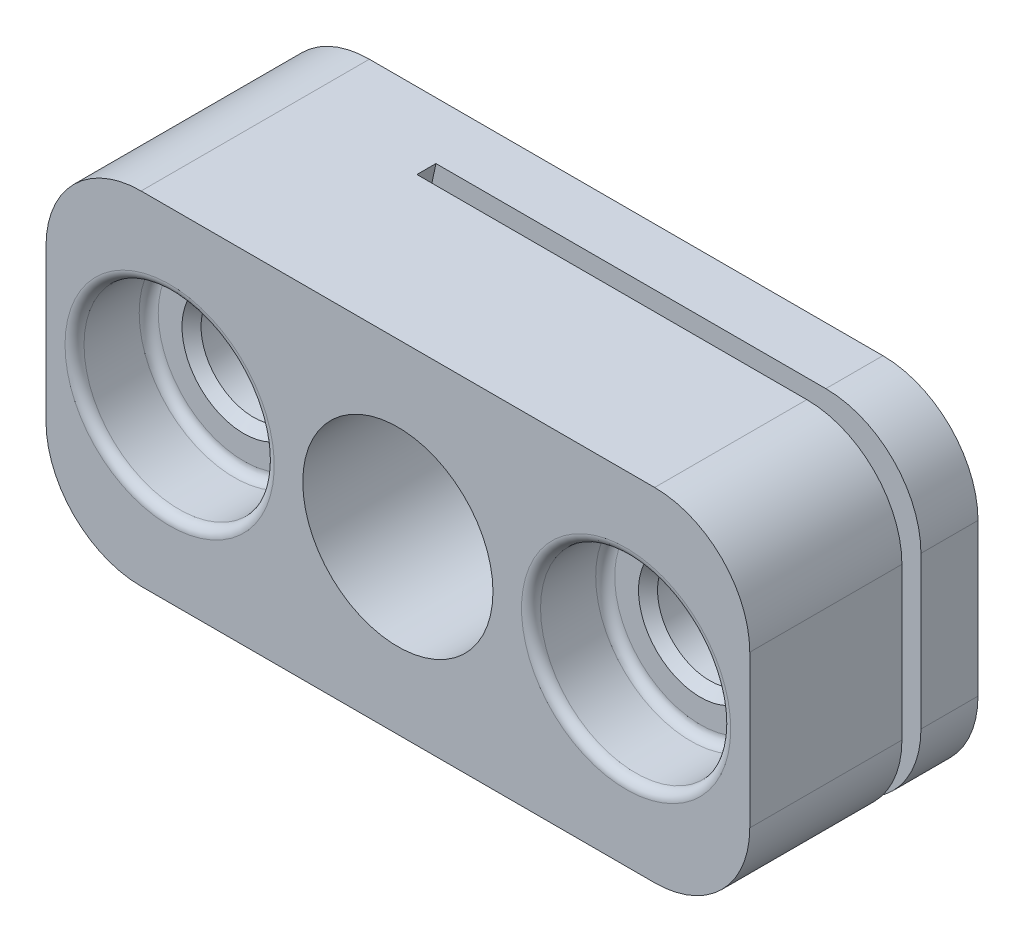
ISO-10303-21;
HEADER;
FILE_DESCRIPTION(('STEP AP214'),'2;1');
FILE_NAME('part.step','',(''),(''),'','','');
FILE_SCHEMA(('AUTOMOTIVE_DESIGN { 1 0 10303 214 1 1 1 1 }'));
ENDSEC;
DATA;
#1=APPLICATION_CONTEXT('core data for automotive mechanical design processes');
#2=APPLICATION_PROTOCOL_DEFINITION('international standard','automotive_design',2000,#1);
#3=PRODUCT_CONTEXT('',#1,'mechanical');
#4=PRODUCT('Part','Part','',(#3));
#5=PRODUCT_RELATED_PRODUCT_CATEGORY('part','',(#4));
#6=PRODUCT_DEFINITION_FORMATION('','',#4);
#7=PRODUCT_DEFINITION_CONTEXT('part definition',#1,'design');
#8=PRODUCT_DEFINITION('design','',#6,#7);
#9=PRODUCT_DEFINITION_SHAPE('','',#8);
#10=(LENGTH_UNIT() NAMED_UNIT(*) SI_UNIT(.MILLI.,.METRE.));
#11=(NAMED_UNIT(*) PLANE_ANGLE_UNIT() SI_UNIT($,.RADIAN.));
#12=(NAMED_UNIT(*) SI_UNIT($,.STERADIAN.) SOLID_ANGLE_UNIT());
#13=UNCERTAINTY_MEASURE_WITH_UNIT(LENGTH_MEASURE(1.E-05),#10,'distance_accuracy_value','');
#14=(GEOMETRIC_REPRESENTATION_CONTEXT(3) GLOBAL_UNCERTAINTY_ASSIGNED_CONTEXT((#13)) GLOBAL_UNIT_ASSIGNED_CONTEXT((#10,
#11,#12)) REPRESENTATION_CONTEXT('',''));
#15=CARTESIAN_POINT('',(0.,0.,0.));
#16=DIRECTION('',(0.,0.,1.));
#17=DIRECTION('',(1.,0.,0.));
#18=AXIS2_PLACEMENT_3D('',#15,#16,#17);
#19=CARTESIAN_POINT('',(27.25,0.,8.1));
#20=DIRECTION('',(0.,0.,1.));
#21=DIRECTION('',(1.,0.,0.));
#22=AXIS2_PLACEMENT_3D('',#19,#20,#21);
#23=PLANE('',#22);
#24=CARTESIAN_POINT('',(24.,0.,8.1000000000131));
#25=DIRECTION('',(0.,0.,1.));
#26=DIRECTION('',(1.,0.,0.));
#27=AXIS2_PLACEMENT_3D('',#24,#25,#26);
#28=CIRCLE('',#27,3.24999999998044);
#29=CARTESIAN_POINT('',(27.2499999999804,0.,8.1000000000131));
#30=VERTEX_POINT('',#29);
#31=EDGE_CURVE('E18',#30,#30,#28,.F.);
#32=ORIENTED_EDGE('',*,*,#31,.T.);
#33=EDGE_LOOP('',(#32));
#34=FACE_BOUND('',#33,.T.);
#35=CARTESIAN_POINT('',(24.,0.,8.09999999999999));
#36=DIRECTION('',(0.,0.,-1.));
#37=DIRECTION('',(1.,0.,0.));
#38=AXIS2_PLACEMENT_3D('',#35,#36,#37);
#39=CIRCLE('',#38,4.50000000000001);
#40=CARTESIAN_POINT('',(28.5,0.,8.09999999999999));
#41=VERTEX_POINT('',#40);
#42=EDGE_CURVE('E285',#41,#41,#39,.F.);
#43=ORIENTED_EDGE('',*,*,#42,.T.);
#44=EDGE_LOOP('',(#43));
#45=FACE_BOUND('',#44,.T.);
#46=ADVANCED_FACE('F14',(#34,#45),#23,.T.);
#47=CARTESIAN_POINT('',(24.,0.,8.6));
#48=DIRECTION('',(0.,0.,1.));
#49=DIRECTION('',(1.,0.,0.));
#50=AXIS2_PLACEMENT_3D('',#47,#48,#49);
#51=TOROIDAL_SURFACE('',#50,4.5,0.500000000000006);
#52=CARTESIAN_POINT('',(24.,0.,8.6));
#53=DIRECTION('',(0.,0.,-1.));
#54=DIRECTION('',(-1.,0.,0.));
#55=AXIS2_PLACEMENT_3D('',#52,#53,#54);
#56=CIRCLE('',#55,5.);
#57=CARTESIAN_POINT('',(19.,0.,8.6));
#58=VERTEX_POINT('',#57);
#59=EDGE_CURVE('E234',#58,#58,#56,.F.);
#60=ORIENTED_EDGE('',*,*,#59,.T.);
#61=EDGE_LOOP('',(#60));
#62=FACE_BOUND('',#61,.T.);
#63=ORIENTED_EDGE('',*,*,#42,.F.);
#64=EDGE_LOOP('',(#63));
#65=FACE_BOUND('',#64,.T.);
#66=ADVANCED_FACE('F267',(#62,#65),#51,.F.);
#67=CARTESIAN_POINT('',(0.,0.,8.6));
#68=DIRECTION('',(0.,0.,-1.));
#69=DIRECTION('',(-1.,0.,0.));
#70=AXIS2_PLACEMENT_3D('',#67,#68,#69);
#71=TOROIDAL_SURFACE('',#70,4.5,0.500000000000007);
#72=CARTESIAN_POINT('',(0.,0.,8.09999999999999));
#73=DIRECTION('',(0.,0.,-1.));
#74=DIRECTION('',(-1.,0.,0.));
#75=AXIS2_PLACEMENT_3D('',#72,#73,#74);
#76=CIRCLE('',#75,4.50000000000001);
#77=CARTESIAN_POINT('',(-4.50000000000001,0.,8.09999999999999));
#78=VERTEX_POINT('',#77);
#79=EDGE_CURVE('E245',#78,#78,#76,.F.);
#80=ORIENTED_EDGE('',*,*,#79,.F.);
#81=EDGE_LOOP('',(#80));
#82=FACE_BOUND('',#81,.T.);
#83=CARTESIAN_POINT('',(0.,0.,8.6));
#84=DIRECTION('',(0.,0.,1.));
#85=DIRECTION('',(1.,0.,0.));
#86=AXIS2_PLACEMENT_3D('',#83,#84,#85);
#87=CIRCLE('',#86,5.);
#88=CARTESIAN_POINT('',(5.,0.,8.6));
#89=VERTEX_POINT('',#88);
#90=EDGE_CURVE('E231',#89,#89,#87,.T.);
#91=ORIENTED_EDGE('',*,*,#90,.T.);
#92=EDGE_LOOP('',(#91));
#93=FACE_BOUND('',#92,.T.);
#94=ADVANCED_FACE('F263',(#82,#93),#71,.F.);
#95=CARTESIAN_POINT('',(-4.5,0.,8.1));
#96=DIRECTION('',(0.,0.,1.));
#97=DIRECTION('',(1.,0.,0.));
#98=AXIS2_PLACEMENT_3D('',#95,#96,#97);
#99=PLANE('',#98);
#100=ORIENTED_EDGE('',*,*,#79,.T.);
#101=EDGE_LOOP('',(#100));
#102=FACE_BOUND('',#101,.T.);
#103=CARTESIAN_POINT('',(0.,0.,8.1000000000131));
#104=DIRECTION('',(0.,0.,1.));
#105=DIRECTION('',(1.,0.,0.));
#106=AXIS2_PLACEMENT_3D('',#103,#104,#105);
#107=CIRCLE('',#106,3.25000000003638);
#108=CARTESIAN_POINT('',(3.25000000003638,0.,8.1000000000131));
#109=VERTEX_POINT('',#108);
#110=EDGE_CURVE('E228',#109,#109,#107,.F.);
#111=ORIENTED_EDGE('',*,*,#110,.T.);
#112=EDGE_LOOP('',(#111));
#113=FACE_BOUND('',#112,.T.);
#114=ADVANCED_FACE('F252',(#102,#113),#99,.T.);
#115=CARTESIAN_POINT('',(24.,0.,8.1000000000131));
#116=DIRECTION('',(0.,0.,1.));
#117=DIRECTION('',(1.,0.,0.));
#118=AXIS2_PLACEMENT_3D('',#115,#116,#117);
#119=CONICAL_SURFACE('',#118,3.24999999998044,0.785398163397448);
#120=CARTESIAN_POINT('',(24.,0.,7.6));
#121=DIRECTION('',(0.,0.,-1.));
#122=DIRECTION('',(-1.,0.,0.));
#123=AXIS2_PLACEMENT_3D('',#120,#121,#122);
#124=CIRCLE('',#123,2.75);
#125=CARTESIAN_POINT('',(21.25,0.,7.6));
#126=VERTEX_POINT('',#125);
#127=EDGE_CURVE('E224',#126,#126,#124,.T.);
#128=ORIENTED_EDGE('',*,*,#127,.T.);
#129=EDGE_LOOP('',(#128));
#130=FACE_BOUND('',#129,.T.);
#131=ORIENTED_EDGE('',*,*,#31,.F.);
#132=EDGE_LOOP('',(#131));
#133=FACE_BOUND('',#132,.T.);
#134=ADVANCED_FACE('F262',(#130,#133),#119,.F.);
#135=CARTESIAN_POINT('',(24.,0.,12.));
#136=DIRECTION('',(0.,0.,-1.));
#137=DIRECTION('',(-1.,0.,0.));
#138=AXIS2_PLACEMENT_3D('',#135,#136,#137);
#139=CYLINDRICAL_SURFACE('',#138,5.);
#140=ORIENTED_EDGE('',*,*,#59,.F.);
#141=EDGE_LOOP('',(#140));
#142=FACE_BOUND('',#141,.T.);
#143=CARTESIAN_POINT('',(24.,0.,11.5));
#144=DIRECTION('',(0.,0.,1.));
#145=DIRECTION('',(1.,0.,0.));
#146=AXIS2_PLACEMENT_3D('',#143,#144,#145);
#147=CIRCLE('',#146,5.);
#148=CARTESIAN_POINT('',(29.,0.,11.5));
#149=VERTEX_POINT('',#148);
#150=EDGE_CURVE('E125',#149,#149,#147,.F.);
#151=ORIENTED_EDGE('',*,*,#150,.F.);
#152=EDGE_LOOP('',(#151));
#153=FACE_BOUND('',#152,.T.);
#154=ADVANCED_FACE('F505',(#142,#153),#139,.F.);
#155=CARTESIAN_POINT('',(0.,0.,0.));
#156=DIRECTION('',(0.,0.,1.));
#157=DIRECTION('',(1.,0.,0.));
#158=AXIS2_PLACEMENT_3D('',#155,#156,#157);
#159=CYLINDRICAL_SURFACE('',#158,5.);
#160=CARTESIAN_POINT('',(0.,0.,11.5));
#161=DIRECTION('',(0.,0.,-1.));
#162=DIRECTION('',(-1.,0.,0.));
#163=AXIS2_PLACEMENT_3D('',#160,#161,#162);
#164=CIRCLE('',#163,5.);
#165=CARTESIAN_POINT('',(-5.,0.,11.5));
#166=VERTEX_POINT('',#165);
#167=EDGE_CURVE('E171',#166,#166,#164,.T.);
#168=ORIENTED_EDGE('',*,*,#167,.F.);
#169=EDGE_LOOP('',(#168));
#170=FACE_BOUND('',#169,.T.);
#171=ORIENTED_EDGE('',*,*,#90,.F.);
#172=EDGE_LOOP('',(#171));
#173=FACE_BOUND('',#172,.T.);
#174=ADVANCED_FACE('F349',(#170,#173),#159,.F.);
#175=CARTESIAN_POINT('',(0.,0.,8.1000000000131));
#176=DIRECTION('',(0.,0.,1.));
#177=DIRECTION('',(1.,0.,0.));
#178=AXIS2_PLACEMENT_3D('',#175,#176,#177);
#179=CONICAL_SURFACE('',#178,3.25000000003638,0.785398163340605);
#180=ORIENTED_EDGE('',*,*,#110,.F.);
#181=EDGE_LOOP('',(#180));
#182=FACE_BOUND('',#181,.T.);
#183=CARTESIAN_POINT('',(0.,0.,7.6));
#184=DIRECTION('',(0.,0.,1.));
#185=DIRECTION('',(1.,0.,0.));
#186=AXIS2_PLACEMENT_3D('',#183,#184,#185);
#187=CIRCLE('',#186,2.75);
#188=CARTESIAN_POINT('',(2.75,0.,7.6));
#189=VERTEX_POINT('',#188);
#190=EDGE_CURVE('E167',#189,#189,#187,.F.);
#191=ORIENTED_EDGE('',*,*,#190,.T.);
#192=EDGE_LOOP('',(#191));
#193=FACE_BOUND('',#192,.T.);
#194=ADVANCED_FACE('F345',(#182,#193),#179,.F.);
#195=CARTESIAN_POINT('',(24.,0.,12.));
#196=DIRECTION('',(0.,0.,-1.));
#197=DIRECTION('',(-1.,0.,0.));
#198=AXIS2_PLACEMENT_3D('',#195,#196,#197);
#199=CYLINDRICAL_SURFACE('',#198,2.75);
#200=CARTESIAN_POINT('',(24.,0.,4.));
#201=DIRECTION('',(0.,0.,-1.));
#202=DIRECTION('',(-1.,0.,0.));
#203=AXIS2_PLACEMENT_3D('',#200,#201,#202);
#204=CIRCLE('',#203,2.75);
#205=CARTESIAN_POINT('',(21.25,0.,4.));
#206=VERTEX_POINT('',#205);
#207=EDGE_CURVE('E135',#206,#206,#204,.T.);
#208=ORIENTED_EDGE('',*,*,#207,.T.);
#209=EDGE_LOOP('',(#208));
#210=FACE_BOUND('',#209,.T.);
#211=ORIENTED_EDGE('',*,*,#127,.F.);
#212=EDGE_LOOP('',(#211));
#213=FACE_BOUND('',#212,.T.);
#214=ADVANCED_FACE('F348',(#210,#213),#199,.F.);
#215=CARTESIAN_POINT('',(43.9743505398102,0.,4.));
#216=DIRECTION('',(0.,0.,1.));
#217=DIRECTION('',(1.,0.,0.));
#218=AXIS2_PLACEMENT_3D('',#215,#216,#217);
#219=CYLINDRICAL_SURFACE('',#218,40.);
#220=DIRECTION('',(0.,0.,1.));
#221=VECTOR('',#220,1.);
#222=CARTESIAN_POINT('',(5.,9.,4.));
#223=LINE('',#222,#221);
#224=CARTESIAN_POINT('',(5.,9.,4.));
#225=VERTEX_POINT('',#224);
#226=CARTESIAN_POINT('',(5.,9.,3.));
#227=VERTEX_POINT('',#226);
#228=EDGE_CURVE('E113',#225,#227,#223,.F.);
#229=ORIENTED_EDGE('',*,*,#228,.F.);
#230=CARTESIAN_POINT('',(43.9743505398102,0.,4.));
#231=DIRECTION('',(0.,0.,1.));
#232=DIRECTION('',(1.,0.,0.));
#233=AXIS2_PLACEMENT_3D('',#230,#231,#232);
#234=CIRCLE('',#233,40.);
#235=CARTESIAN_POINT('',(5.,-9.,4.));
#236=VERTEX_POINT('',#235);
#237=EDGE_CURVE('E177',#225,#236,#234,.T.);
#238=ORIENTED_EDGE('',*,*,#237,.T.);
#239=DIRECTION('',(0.,0.,1.));
#240=VECTOR('',#239,1.);
#241=CARTESIAN_POINT('',(5.,-9.,4.));
#242=LINE('',#241,#240);
#243=CARTESIAN_POINT('',(5.,-9.,3.));
#244=VERTEX_POINT('',#243);
#245=EDGE_CURVE('E126',#244,#236,#242,.T.);
#246=ORIENTED_EDGE('',*,*,#245,.F.);
#247=CARTESIAN_POINT('',(43.9743505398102,0.,3.));
#248=DIRECTION('',(0.,0.,1.));
#249=DIRECTION('',(1.,0.,0.));
#250=AXIS2_PLACEMENT_3D('',#247,#248,#249);
#251=CIRCLE('',#250,40.);
#252=EDGE_CURVE('E130',#227,#244,#251,.T.);
#253=ORIENTED_EDGE('',*,*,#252,.F.);
#254=EDGE_LOOP('',(#229,#238,#246,#253));
#255=FACE_BOUND('',#254,.T.);
#256=ADVANCED_FACE('F131',(#255),#219,.F.);
#257=CARTESIAN_POINT('',(24.,0.,11.5));
#258=DIRECTION('',(0.,0.,1.));
#259=DIRECTION('',(1.,0.,0.));
#260=AXIS2_PLACEMENT_3D('',#257,#258,#259);
#261=TOROIDAL_SURFACE('',#260,5.5,0.5);
#262=ORIENTED_EDGE('',*,*,#150,.T.);
#263=EDGE_LOOP('',(#262));
#264=FACE_BOUND('',#263,.T.);
#265=CARTESIAN_POINT('',(24.,0.,12.));
#266=DIRECTION('',(0.,0.,1.));
#267=DIRECTION('',(1.,0.,0.));
#268=AXIS2_PLACEMENT_3D('',#265,#266,#267);
#269=CIRCLE('',#268,5.5);
#270=CARTESIAN_POINT('',(29.5,0.,12.));
#271=VERTEX_POINT('',#270);
#272=EDGE_CURVE('E215',#271,#271,#269,.F.);
#273=ORIENTED_EDGE('',*,*,#272,.F.);
#274=EDGE_LOOP('',(#273));
#275=FACE_BOUND('',#274,.T.);
#276=ADVANCED_FACE('F189',(#264,#275),#261,.T.);
#277=CARTESIAN_POINT('',(0.,0.,11.5));
#278=DIRECTION('',(0.,0.,-1.));
#279=DIRECTION('',(-1.,0.,0.));
#280=AXIS2_PLACEMENT_3D('',#277,#278,#279);
#281=TOROIDAL_SURFACE('',#280,5.5,0.5);
#282=CARTESIAN_POINT('',(0.,0.,12.));
#283=DIRECTION('',(0.,0.,1.));
#284=DIRECTION('',(-1.,0.,0.));
#285=AXIS2_PLACEMENT_3D('',#282,#283,#284);
#286=CIRCLE('',#285,5.5);
#287=CARTESIAN_POINT('',(-5.5,0.,12.));
#288=VERTEX_POINT('',#287);
#289=EDGE_CURVE('E331',#288,#288,#286,.F.);
#290=ORIENTED_EDGE('',*,*,#289,.F.);
#291=EDGE_LOOP('',(#290));
#292=FACE_BOUND('',#291,.T.);
#293=ORIENTED_EDGE('',*,*,#167,.T.);
#294=EDGE_LOOP('',(#293));
#295=FACE_BOUND('',#294,.T.);
#296=ADVANCED_FACE('F183',(#292,#295),#281,.T.);
#297=CARTESIAN_POINT('',(30.5,-4.,12.));
#298=DIRECTION('',(-1.,0.,0.));
#299=DIRECTION('',(0.,0.,1.));
#300=AXIS2_PLACEMENT_3D('',#297,#298,#299);
#301=PLANE('',#300);
#302=DIRECTION('',(0.,1.,0.));
#303=VECTOR('',#302,1.);
#304=CARTESIAN_POINT('',(30.5,0.,4.));
#305=LINE('',#304,#303);
#306=CARTESIAN_POINT('',(30.5,-4.,4.));
#307=VERTEX_POINT('',#306);
#308=CARTESIAN_POINT('',(30.5,4.,4.));
#309=VERTEX_POINT('',#308);
#310=EDGE_CURVE('E334',#307,#309,#305,.T.);
#311=ORIENTED_EDGE('',*,*,#310,.T.);
#312=DIRECTION('',(0.,0.,1.));
#313=VECTOR('',#312,1.);
#314=CARTESIAN_POINT('',(30.5,4.,12.));
#315=LINE('',#314,#313);
#316=CARTESIAN_POINT('',(30.5,4.,12.));
#317=VERTEX_POINT('',#316);
#318=EDGE_CURVE('E174',#317,#309,#315,.F.);
#319=ORIENTED_EDGE('',*,*,#318,.F.);
#320=DIRECTION('',(0.,1.,0.));
#321=VECTOR('',#320,1.);
#322=CARTESIAN_POINT('',(30.5,-4.,12.));
#323=LINE('',#322,#321);
#324=CARTESIAN_POINT('',(30.5,-4.,12.));
#325=VERTEX_POINT('',#324);
#326=EDGE_CURVE('E327',#325,#317,#323,.T.);
#327=ORIENTED_EDGE('',*,*,#326,.F.);
#328=DIRECTION('',(0.,0.,1.));
#329=VECTOR('',#328,1.);
#330=CARTESIAN_POINT('',(30.5,-4.,12.));
#331=LINE('',#330,#329);
#332=EDGE_CURVE('E170',#307,#325,#331,.T.);
#333=ORIENTED_EDGE('',*,*,#332,.F.);
#334=EDGE_LOOP('',(#311,#319,#327,#333));
#335=FACE_BOUND('',#334,.T.);
#336=ADVANCED_FACE('F188',(#335),#301,.F.);
#337=CARTESIAN_POINT('',(24.,0.,12.));
#338=DIRECTION('',(0.,0.,-1.));
#339=DIRECTION('',(-1.,0.,0.));
#340=AXIS2_PLACEMENT_3D('',#337,#338,#339);
#341=CYLINDRICAL_SURFACE('',#340,2.75);
#342=CARTESIAN_POINT('',(24.,0.,0.499999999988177));
#343=DIRECTION('',(0.,0.,-1.));
#344=DIRECTION('',(-1.,0.,0.));
#345=AXIS2_PLACEMENT_3D('',#342,#343,#344);
#346=CIRCLE('',#345,2.74999999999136);
#347=CARTESIAN_POINT('',(21.2500000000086,0.,0.499999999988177));
#348=VERTEX_POINT('',#347);
#349=EDGE_CURVE('E326',#348,#348,#346,.T.);
#350=ORIENTED_EDGE('',*,*,#349,.T.);
#351=EDGE_LOOP('',(#350));
#352=FACE_BOUND('',#351,.T.);
#353=CARTESIAN_POINT('',(24.,0.,3.));
#354=DIRECTION('',(0.,0.,-1.));
#355=DIRECTION('',(-1.,0.,0.));
#356=AXIS2_PLACEMENT_3D('',#353,#354,#355);
#357=CIRCLE('',#356,2.75);
#358=CARTESIAN_POINT('',(21.25,0.,3.));
#359=VERTEX_POINT('',#358);
#360=EDGE_CURVE('E136',#359,#359,#357,.T.);
#361=ORIENTED_EDGE('',*,*,#360,.F.);
#362=EDGE_LOOP('',(#361));
#363=FACE_BOUND('',#362,.T.);
#364=ADVANCED_FACE('F357',(#352,#363),#341,.F.);
#365=CARTESIAN_POINT('',(0.,0.,0.));
#366=DIRECTION('',(0.,0.,1.));
#367=DIRECTION('',(1.,0.,0.));
#368=AXIS2_PLACEMENT_3D('',#365,#366,#367);
#369=CYLINDRICAL_SURFACE('',#368,2.75);
#370=ORIENTED_EDGE('',*,*,#190,.F.);
#371=EDGE_LOOP('',(#370));
#372=FACE_BOUND('',#371,.T.);
#373=CARTESIAN_POINT('',(0.,0.,0.50000000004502));
#374=DIRECTION('',(0.,0.,-1.));
#375=DIRECTION('',(-1.,0.,0.));
#376=AXIS2_PLACEMENT_3D('',#373,#374,#375);
#377=CIRCLE('',#376,2.74999999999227);
#378=CARTESIAN_POINT('',(-2.74999999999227,0.,0.50000000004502));
#379=VERTEX_POINT('',#378);
#380=EDGE_CURVE('E323',#379,#379,#377,.T.);
#381=ORIENTED_EDGE('',*,*,#380,.T.);
#382=EDGE_LOOP('',(#381));
#383=FACE_BOUND('',#382,.T.);
#384=ADVANCED_FACE('F353',(#372,#383),#369,.F.);
#385=CARTESIAN_POINT('',(25.5,-4.,12.));
#386=DIRECTION('',(0.,0.,1.));
#387=DIRECTION('',(1.,0.,0.));
#388=AXIS2_PLACEMENT_3D('',#385,#386,#387);
#389=CYLINDRICAL_SURFACE('',#388,5.);
#390=ORIENTED_EDGE('',*,*,#332,.T.);
#391=CARTESIAN_POINT('',(25.5,-4.,12.));
#392=DIRECTION('',(0.,0.,1.));
#393=DIRECTION('',(1.,0.,0.));
#394=AXIS2_PLACEMENT_3D('',#391,#392,#393);
#395=CIRCLE('',#394,5.);
#396=CARTESIAN_POINT('',(25.5,-9.,12.));
#397=VERTEX_POINT('',#396);
#398=EDGE_CURVE('E328',#397,#325,#395,.T.);
#399=ORIENTED_EDGE('',*,*,#398,.F.);
#400=DIRECTION('',(0.,0.,1.));
#401=VECTOR('',#400,1.);
#402=CARTESIAN_POINT('',(25.5,-9.,12.));
#403=LINE('',#402,#401);
#404=CARTESIAN_POINT('',(25.5,-9.,4.));
#405=VERTEX_POINT('',#404);
#406=EDGE_CURVE('E157',#397,#405,#403,.F.);
#407=ORIENTED_EDGE('',*,*,#406,.T.);
#408=CARTESIAN_POINT('',(25.5,-4.,4.));
#409=DIRECTION('',(0.,0.,1.));
#410=DIRECTION('',(1.,0.,0.));
#411=AXIS2_PLACEMENT_3D('',#408,#409,#410);
#412=CIRCLE('',#411,5.);
#413=EDGE_CURVE('E335',#405,#307,#412,.T.);
#414=ORIENTED_EDGE('',*,*,#413,.T.);
#415=EDGE_LOOP('',(#390,#399,#407,#414));
#416=FACE_BOUND('',#415,.T.);
#417=ADVANCED_FACE('F356',(#416),#389,.T.);
#418=CARTESIAN_POINT('',(43.9743505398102,0.,3.));
#419=DIRECTION('',(0.,0.,1.));
#420=DIRECTION('',(1.,0.,0.));
#421=AXIS2_PLACEMENT_3D('',#418,#419,#420);
#422=PLANE('',#421);
#423=CARTESIAN_POINT('',(12.,0.,3.));
#424=DIRECTION('',(0.,0.,1.));
#425=DIRECTION('',(1.,0.,0.));
#426=AXIS2_PLACEMENT_3D('',#423,#424,#425);
#427=CIRCLE('',#426,4.99999999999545);
#428=CARTESIAN_POINT('',(16.9999999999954,0.,3.));
#429=VERTEX_POINT('',#428);
#430=EDGE_CURVE('E455',#429,#429,#427,.T.);
#431=ORIENTED_EDGE('',*,*,#430,.F.);
#432=EDGE_LOOP('',(#431));
#433=FACE_BOUND('',#432,.T.);
#434=ORIENTED_EDGE('',*,*,#252,.T.);
#435=DIRECTION('',(1.,0.,0.));
#436=VECTOR('',#435,1.);
#437=CARTESIAN_POINT('',(-1.5,-9.,3.));
#438=LINE('',#437,#436);
#439=CARTESIAN_POINT('',(25.5,-9.,3.));
#440=VERTEX_POINT('',#439);
#441=EDGE_CURVE('E153',#244,#440,#438,.T.);
#442=ORIENTED_EDGE('',*,*,#441,.T.);
#443=CARTESIAN_POINT('',(25.5,-4.,3.));
#444=DIRECTION('',(0.,0.,1.));
#445=DIRECTION('',(1.,0.,0.));
#446=AXIS2_PLACEMENT_3D('',#443,#444,#445);
#447=CIRCLE('',#446,5.);
#448=CARTESIAN_POINT('',(30.5,-4.,3.));
#449=VERTEX_POINT('',#448);
#450=EDGE_CURVE('E164',#449,#440,#447,.F.);
#451=ORIENTED_EDGE('',*,*,#450,.F.);
#452=DIRECTION('',(0.,1.,0.));
#453=VECTOR('',#452,1.);
#454=CARTESIAN_POINT('',(30.5,-4.,3.));
#455=LINE('',#454,#453);
#456=CARTESIAN_POINT('',(30.5,4.,3.));
#457=VERTEX_POINT('',#456);
#458=EDGE_CURVE('E150',#449,#457,#455,.T.);
#459=ORIENTED_EDGE('',*,*,#458,.T.);
#460=CARTESIAN_POINT('',(25.5,4.,3.));
#461=DIRECTION('',(0.,0.,1.));
#462=DIRECTION('',(1.,0.,0.));
#463=AXIS2_PLACEMENT_3D('',#460,#461,#462);
#464=CIRCLE('',#463,5.);
#465=CARTESIAN_POINT('',(25.5,9.,3.));
#466=VERTEX_POINT('',#465);
#467=EDGE_CURVE('E141',#466,#457,#464,.F.);
#468=ORIENTED_EDGE('',*,*,#467,.F.);
#469=DIRECTION('',(1.,0.,0.));
#470=VECTOR('',#469,1.);
#471=CARTESIAN_POINT('',(25.5,9.,3.));
#472=LINE('',#471,#470);
#473=EDGE_CURVE('E117',#466,#227,#472,.F.);
#474=ORIENTED_EDGE('',*,*,#473,.T.);
#475=EDGE_LOOP('',(#434,#442,#451,#459,#468,#474));
#476=FACE_BOUND('',#475,.T.);
#477=ORIENTED_EDGE('',*,*,#360,.T.);
#478=EDGE_LOOP('',(#477));
#479=FACE_BOUND('',#478,.T.);
#480=ADVANCED_FACE('F138',(#433,#476,#479),#422,.T.);
#481=CARTESIAN_POINT('',(43.9743505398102,0.,4.));
#482=DIRECTION('',(0.,0.,1.));
#483=DIRECTION('',(1.,0.,0.));
#484=AXIS2_PLACEMENT_3D('',#481,#482,#483);
#485=PLANE('',#484);
#486=CARTESIAN_POINT('',(12.,0.,4.));
#487=DIRECTION('',(0.,0.,1.));
#488=DIRECTION('',(1.,0.,0.));
#489=AXIS2_PLACEMENT_3D('',#486,#487,#488);
#490=CIRCLE('',#489,4.99999999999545);
#491=CARTESIAN_POINT('',(16.9999999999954,0.,4.));
#492=VERTEX_POINT('',#491);
#493=EDGE_CURVE('E458',#492,#492,#490,.T.);
#494=ORIENTED_EDGE('',*,*,#493,.T.);
#495=EDGE_LOOP('',(#494));
#496=FACE_BOUND('',#495,.T.);
#497=ORIENTED_EDGE('',*,*,#237,.F.);
#498=DIRECTION('',(1.,0.,0.));
#499=VECTOR('',#498,1.);
#500=CARTESIAN_POINT('',(25.5,9.,4.));
#501=LINE('',#500,#499);
#502=CARTESIAN_POINT('',(25.5,9.,4.));
#503=VERTEX_POINT('',#502);
#504=EDGE_CURVE('E121',#225,#503,#501,.T.);
#505=ORIENTED_EDGE('',*,*,#504,.T.);
#506=CARTESIAN_POINT('',(25.5,4.,4.));
#507=DIRECTION('',(0.,0.,1.));
#508=DIRECTION('',(1.,0.,0.));
#509=AXIS2_PLACEMENT_3D('',#506,#507,#508);
#510=CIRCLE('',#509,5.);
#511=EDGE_CURVE('E176',#309,#503,#510,.T.);
#512=ORIENTED_EDGE('',*,*,#511,.F.);
#513=ORIENTED_EDGE('',*,*,#310,.F.);
#514=ORIENTED_EDGE('',*,*,#413,.F.);
#515=DIRECTION('',(1.,0.,0.));
#516=VECTOR('',#515,1.);
#517=CARTESIAN_POINT('',(-1.5,-9.,4.));
#518=LINE('',#517,#516);
#519=EDGE_CURVE('E160',#405,#236,#518,.F.);
#520=ORIENTED_EDGE('',*,*,#519,.T.);
#521=EDGE_LOOP('',(#497,#505,#512,#513,#514,#520));
#522=FACE_BOUND('',#521,.T.);
#523=ORIENTED_EDGE('',*,*,#207,.F.);
#524=EDGE_LOOP('',(#523));
#525=FACE_BOUND('',#524,.T.);
#526=ADVANCED_FACE('F418',(#496,#522,#525),#485,.F.);
#527=CARTESIAN_POINT('',(25.5,4.,12.));
#528=DIRECTION('',(0.,0.,1.));
#529=DIRECTION('',(1.,0.,0.));
#530=AXIS2_PLACEMENT_3D('',#527,#528,#529);
#531=CYLINDRICAL_SURFACE('',#530,5.);
#532=DIRECTION('',(0.,0.,-1.));
#533=VECTOR('',#532,1.);
#534=CARTESIAN_POINT('',(25.5,9.,12.));
#535=LINE('',#534,#533);
#536=CARTESIAN_POINT('',(25.5,9.,12.));
#537=VERTEX_POINT('',#536);
#538=EDGE_CURVE('E144',#503,#537,#535,.F.);
#539=ORIENTED_EDGE('',*,*,#538,.T.);
#540=CARTESIAN_POINT('',(25.5,4.,12.));
#541=DIRECTION('',(0.,0.,1.));
#542=DIRECTION('',(1.,0.,0.));
#543=AXIS2_PLACEMENT_3D('',#540,#541,#542);
#544=CIRCLE('',#543,5.);
#545=EDGE_CURVE('E324',#317,#537,#544,.T.);
#546=ORIENTED_EDGE('',*,*,#545,.F.);
#547=ORIENTED_EDGE('',*,*,#318,.T.);
#548=ORIENTED_EDGE('',*,*,#511,.T.);
#549=EDGE_LOOP('',(#539,#546,#547,#548));
#550=FACE_BOUND('',#549,.T.);
#551=ADVANCED_FACE('F394',(#550),#531,.T.);
#552=CARTESIAN_POINT('',(-1.5,-4.,12.));
#553=DIRECTION('',(0.,0.,1.));
#554=DIRECTION('',(1.,0.,0.));
#555=AXIS2_PLACEMENT_3D('',#552,#553,#554);
#556=PLANE('',#555);
#557=DIRECTION('',(1.,0.,0.));
#558=VECTOR('',#557,1.);
#559=CARTESIAN_POINT('',(25.5,9.,12.));
#560=LINE('',#559,#558);
#561=CARTESIAN_POINT('',(-1.5,9.,12.));
#562=VERTEX_POINT('',#561);
#563=EDGE_CURVE('E146',#537,#562,#560,.F.);
#564=ORIENTED_EDGE('',*,*,#563,.T.);
#565=CARTESIAN_POINT('',(-1.5,4.,12.));
#566=DIRECTION('',(0.,0.,1.));
#567=DIRECTION('',(1.,0.,0.));
#568=AXIS2_PLACEMENT_3D('',#565,#566,#567);
#569=CIRCLE('',#568,5.);
#570=CARTESIAN_POINT('',(-6.5,4.,12.));
#571=VERTEX_POINT('',#570);
#572=EDGE_CURVE('E315',#571,#562,#569,.F.);
#573=ORIENTED_EDGE('',*,*,#572,.F.);
#574=DIRECTION('',(0.,1.,0.));
#575=VECTOR('',#574,1.);
#576=CARTESIAN_POINT('',(-6.5,4.,12.));
#577=LINE('',#576,#575);
#578=CARTESIAN_POINT('',(-6.5,-4.,12.));
#579=VERTEX_POINT('',#578);
#580=EDGE_CURVE('E372',#571,#579,#577,.F.);
#581=ORIENTED_EDGE('',*,*,#580,.T.);
#582=CARTESIAN_POINT('',(-1.5,-4.,12.));
#583=DIRECTION('',(0.,0.,1.));
#584=DIRECTION('',(1.,0.,0.));
#585=AXIS2_PLACEMENT_3D('',#582,#583,#584);
#586=CIRCLE('',#585,5.);
#587=CARTESIAN_POINT('',(-1.5,-9.,12.));
#588=VERTEX_POINT('',#587);
#589=EDGE_CURVE('E156',#588,#579,#586,.F.);
#590=ORIENTED_EDGE('',*,*,#589,.F.);
#591=DIRECTION('',(1.,0.,0.));
#592=VECTOR('',#591,1.);
#593=CARTESIAN_POINT('',(-1.5,-9.,12.));
#594=LINE('',#593,#592);
#595=EDGE_CURVE('E161',#588,#397,#594,.T.);
#596=ORIENTED_EDGE('',*,*,#595,.T.);
#597=ORIENTED_EDGE('',*,*,#398,.T.);
#598=ORIENTED_EDGE('',*,*,#326,.T.);
#599=ORIENTED_EDGE('',*,*,#545,.T.);
#600=EDGE_LOOP('',(#564,#573,#581,#590,#596,#597,#598,#599));
#601=FACE_BOUND('',#600,.T.);
#602=CARTESIAN_POINT('',(12.,0.,12.));
#603=DIRECTION('',(0.,0.,1.));
#604=DIRECTION('',(1.,0.,0.));
#605=AXIS2_PLACEMENT_3D('',#602,#603,#604);
#606=CIRCLE('',#605,4.99999999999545);
#607=CARTESIAN_POINT('',(16.9999999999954,0.,12.));
#608=VERTEX_POINT('',#607);
#609=EDGE_CURVE('E462',#608,#608,#606,.T.);
#610=ORIENTED_EDGE('',*,*,#609,.F.);
#611=EDGE_LOOP('',(#610));
#612=FACE_BOUND('',#611,.T.);
#613=ORIENTED_EDGE('',*,*,#289,.T.);
#614=EDGE_LOOP('',(#613));
#615=FACE_BOUND('',#614,.T.);
#616=ORIENTED_EDGE('',*,*,#272,.T.);
#617=EDGE_LOOP('',(#616));
#618=FACE_BOUND('',#617,.T.);
#619=ADVANCED_FACE('F383',(#601,#612,#615,#618),#556,.T.);
#620=CARTESIAN_POINT('',(24.,0.,-1.13686837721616E-10));
#621=DIRECTION('',(0.,0.,-1.));
#622=DIRECTION('',(-1.,0.,0.));
#623=AXIS2_PLACEMENT_3D('',#620,#621,#622);
#624=CONICAL_SURFACE('',#623,3.25000000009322,0.785398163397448);
#625=CARTESIAN_POINT('',(24.,0.,-5.6843418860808E-11));
#626=DIRECTION('',(0.,0.,-1.));
#627=DIRECTION('',(-1.,0.,0.));
#628=AXIS2_PLACEMENT_3D('',#625,#626,#627);
#629=CIRCLE('',#628,3.25000000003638);
#630=CARTESIAN_POINT('',(20.7499999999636,0.,-5.6843418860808E-11));
#631=VERTEX_POINT('',#630);
#632=EDGE_CURVE('E311',#631,#631,#629,.T.);
#633=ORIENTED_EDGE('',*,*,#632,.T.);
#634=EDGE_LOOP('',(#633));
#635=FACE_BOUND('',#634,.T.);
#636=ORIENTED_EDGE('',*,*,#349,.F.);
#637=EDGE_LOOP('',(#636));
#638=FACE_BOUND('',#637,.T.);
#639=ADVANCED_FACE('F393',(#635,#638),#624,.F.);
#640=CARTESIAN_POINT('',(0.,0.,-5.6843418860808E-11));
#641=DIRECTION('',(0.,0.,-1.));
#642=DIRECTION('',(-1.,0.,0.));
#643=AXIS2_PLACEMENT_3D('',#640,#641,#642);
#644=CONICAL_SURFACE('',#643,3.25000000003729,0.785398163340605);
#645=ORIENTED_EDGE('',*,*,#380,.F.);
#646=EDGE_LOOP('',(#645));
#647=FACE_BOUND('',#646,.T.);
#648=CARTESIAN_POINT('',(0.,0.,0.));
#649=DIRECTION('',(0.,0.,-1.));
#650=DIRECTION('',(-1.,0.,0.));
#651=AXIS2_PLACEMENT_3D('',#648,#649,#650);
#652=CIRCLE('',#651,3.24999999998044);
#653=CARTESIAN_POINT('',(-3.24999999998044,0.,0.));
#654=VERTEX_POINT('',#653);
#655=EDGE_CURVE('E308',#654,#654,#652,.T.);
#656=ORIENTED_EDGE('',*,*,#655,.T.);
#657=EDGE_LOOP('',(#656));
#658=FACE_BOUND('',#657,.T.);
#659=ADVANCED_FACE('F633',(#647,#658),#644,.F.);
#660=CARTESIAN_POINT('',(-1.5,-4.,12.));
#661=DIRECTION('',(0.,0.,1.));
#662=DIRECTION('',(1.,0.,0.));
#663=AXIS2_PLACEMENT_3D('',#660,#661,#662);
#664=CYLINDRICAL_SURFACE('',#663,5.);
#665=ORIENTED_EDGE('',*,*,#589,.T.);
#666=DIRECTION('',(0.,0.,-1.));
#667=VECTOR('',#666,1.);
#668=CARTESIAN_POINT('',(-6.5,-4.,12.));
#669=LINE('',#668,#667);
#670=CARTESIAN_POINT('',(-6.5,-4.,0.));
#671=VERTEX_POINT('',#670);
#672=EDGE_CURVE('E314',#579,#671,#669,.T.);
#673=ORIENTED_EDGE('',*,*,#672,.T.);
#674=CARTESIAN_POINT('',(-1.5,-4.,0.));
#675=DIRECTION('',(0.,0.,1.));
#676=DIRECTION('',(1.,0.,0.));
#677=AXIS2_PLACEMENT_3D('',#674,#675,#676);
#678=CIRCLE('',#677,5.);
#679=CARTESIAN_POINT('',(-1.5,-9.,0.));
#680=VERTEX_POINT('',#679);
#681=EDGE_CURVE('E305',#671,#680,#678,.T.);
#682=ORIENTED_EDGE('',*,*,#681,.T.);
#683=DIRECTION('',(0.,0.,1.));
#684=VECTOR('',#683,1.);
#685=CARTESIAN_POINT('',(-1.5,-9.,12.));
#686=LINE('',#685,#684);
#687=EDGE_CURVE('E155',#680,#588,#686,.T.);
#688=ORIENTED_EDGE('',*,*,#687,.T.);
#689=EDGE_LOOP('',(#665,#673,#682,#688));
#690=FACE_BOUND('',#689,.T.);
#691=ADVANCED_FACE('F642',(#690),#664,.T.);
#692=CARTESIAN_POINT('',(-1.5,-9.,12.));
#693=DIRECTION('',(0.,1.,0.));
#694=DIRECTION('',(0.,0.,1.));
#695=AXIS2_PLACEMENT_3D('',#692,#693,#694);
#696=PLANE('',#695);
#697=ORIENTED_EDGE('',*,*,#519,.F.);
#698=ORIENTED_EDGE('',*,*,#406,.F.);
#699=ORIENTED_EDGE('',*,*,#595,.F.);
#700=ORIENTED_EDGE('',*,*,#687,.F.);
#701=DIRECTION('',(1.,0.,0.));
#702=VECTOR('',#701,1.);
#703=CARTESIAN_POINT('',(-1.5,-9.,0.));
#704=LINE('',#703,#702);
#705=CARTESIAN_POINT('',(25.5,-9.,0.));
#706=VERTEX_POINT('',#705);
#707=EDGE_CURVE('E304',#680,#706,#704,.T.);
#708=ORIENTED_EDGE('',*,*,#707,.T.);
#709=DIRECTION('',(0.,0.,1.));
#710=VECTOR('',#709,1.);
#711=CARTESIAN_POINT('',(25.5,-9.,12.));
#712=LINE('',#711,#710);
#713=EDGE_CURVE('E321',#440,#706,#712,.F.);
#714=ORIENTED_EDGE('',*,*,#713,.F.);
#715=ORIENTED_EDGE('',*,*,#441,.F.);
#716=ORIENTED_EDGE('',*,*,#245,.T.);
#717=EDGE_LOOP('',(#697,#698,#699,#700,#708,#714,#715,#716));
#718=FACE_BOUND('',#717,.T.);
#719=ADVANCED_FACE('F431',(#718),#696,.F.);
#720=CARTESIAN_POINT('',(25.5,-4.,12.));
#721=DIRECTION('',(0.,0.,1.));
#722=DIRECTION('',(1.,0.,0.));
#723=AXIS2_PLACEMENT_3D('',#720,#721,#722);
#724=CYLINDRICAL_SURFACE('',#723,5.);
#725=CARTESIAN_POINT('',(25.5,-4.,0.));
#726=DIRECTION('',(0.,0.,1.));
#727=DIRECTION('',(1.,0.,0.));
#728=AXIS2_PLACEMENT_3D('',#725,#726,#727);
#729=CIRCLE('',#728,5.);
#730=CARTESIAN_POINT('',(30.5,-4.,0.));
#731=VERTEX_POINT('',#730);
#732=EDGE_CURVE('E301',#706,#731,#729,.T.);
#733=ORIENTED_EDGE('',*,*,#732,.T.);
#734=DIRECTION('',(0.,0.,1.));
#735=VECTOR('',#734,1.);
#736=CARTESIAN_POINT('',(30.5,-4.,12.));
#737=LINE('',#736,#735);
#738=EDGE_CURVE('E152',#731,#449,#737,.T.);
#739=ORIENTED_EDGE('',*,*,#738,.T.);
#740=ORIENTED_EDGE('',*,*,#450,.T.);
#741=ORIENTED_EDGE('',*,*,#713,.T.);
#742=EDGE_LOOP('',(#733,#739,#740,#741));
#743=FACE_BOUND('',#742,.T.);
#744=ADVANCED_FACE('F443',(#743),#724,.T.);
#745=CARTESIAN_POINT('',(30.5,-4.,12.));
#746=DIRECTION('',(-1.,0.,0.));
#747=DIRECTION('',(0.,0.,1.));
#748=AXIS2_PLACEMENT_3D('',#745,#746,#747);
#749=PLANE('',#748);
#750=ORIENTED_EDGE('',*,*,#738,.F.);
#751=DIRECTION('',(0.,1.,0.));
#752=VECTOR('',#751,1.);
#753=CARTESIAN_POINT('',(30.5,-4.,0.));
#754=LINE('',#753,#752);
#755=CARTESIAN_POINT('',(30.5,4.,0.));
#756=VERTEX_POINT('',#755);
#757=EDGE_CURVE('E300',#731,#756,#754,.T.);
#758=ORIENTED_EDGE('',*,*,#757,.T.);
#759=DIRECTION('',(0.,0.,1.));
#760=VECTOR('',#759,1.);
#761=CARTESIAN_POINT('',(30.5,4.,12.));
#762=LINE('',#761,#760);
#763=EDGE_CURVE('E319',#457,#756,#762,.F.);
#764=ORIENTED_EDGE('',*,*,#763,.F.);
#765=ORIENTED_EDGE('',*,*,#458,.F.);
#766=EDGE_LOOP('',(#750,#758,#764,#765));
#767=FACE_BOUND('',#766,.T.);
#768=ADVANCED_FACE('F440',(#767),#749,.F.);
#769=CARTESIAN_POINT('',(25.5,4.,12.));
#770=DIRECTION('',(0.,0.,1.));
#771=DIRECTION('',(1.,0.,0.));
#772=AXIS2_PLACEMENT_3D('',#769,#770,#771);
#773=CYLINDRICAL_SURFACE('',#772,5.);
#774=CARTESIAN_POINT('',(25.5,4.,0.));
#775=DIRECTION('',(0.,0.,1.));
#776=DIRECTION('',(1.,0.,0.));
#777=AXIS2_PLACEMENT_3D('',#774,#775,#776);
#778=CIRCLE('',#777,5.);
#779=CARTESIAN_POINT('',(25.5,9.,0.));
#780=VERTEX_POINT('',#779);
#781=EDGE_CURVE('E297',#756,#780,#778,.T.);
#782=ORIENTED_EDGE('',*,*,#781,.T.);
#783=DIRECTION('',(0.,0.,-1.));
#784=VECTOR('',#783,1.);
#785=CARTESIAN_POINT('',(25.5,9.,12.));
#786=LINE('',#785,#784);
#787=EDGE_CURVE('E142',#780,#466,#786,.F.);
#788=ORIENTED_EDGE('',*,*,#787,.T.);
#789=ORIENTED_EDGE('',*,*,#467,.T.);
#790=ORIENTED_EDGE('',*,*,#763,.T.);
#791=EDGE_LOOP('',(#782,#788,#789,#790));
#792=FACE_BOUND('',#791,.T.);
#793=ADVANCED_FACE('F675',(#792),#773,.T.);
#794=CARTESIAN_POINT('',(25.5,9.,12.));
#795=DIRECTION('',(0.,-1.,0.));
#796=DIRECTION('',(0.,0.,-1.));
#797=AXIS2_PLACEMENT_3D('',#794,#795,#796);
#798=PLANE('',#797);
#799=ORIENTED_EDGE('',*,*,#504,.F.);
#800=ORIENTED_EDGE('',*,*,#228,.T.);
#801=ORIENTED_EDGE('',*,*,#473,.F.);
#802=ORIENTED_EDGE('',*,*,#787,.F.);
#803=DIRECTION('',(1.,0.,0.));
#804=VECTOR('',#803,1.);
#805=CARTESIAN_POINT('',(-1.5,9.,0.));
#806=LINE('',#805,#804);
#807=CARTESIAN_POINT('',(-1.5,9.,0.));
#808=VERTEX_POINT('',#807);
#809=EDGE_CURVE('E296',#780,#808,#806,.F.);
#810=ORIENTED_EDGE('',*,*,#809,.T.);
#811=DIRECTION('',(0.,0.,1.));
#812=VECTOR('',#811,1.);
#813=CARTESIAN_POINT('',(-1.5,9.,12.));
#814=LINE('',#813,#812);
#815=EDGE_CURVE('E317',#562,#808,#814,.F.);
#816=ORIENTED_EDGE('',*,*,#815,.F.);
#817=ORIENTED_EDGE('',*,*,#563,.F.);
#818=ORIENTED_EDGE('',*,*,#538,.F.);
#819=EDGE_LOOP('',(#799,#800,#801,#802,#810,#816,#817,#818));
#820=FACE_BOUND('',#819,.T.);
#821=ADVANCED_FACE('F115',(#820),#798,.F.);
#822=CARTESIAN_POINT('',(-1.5,4.,12.));
#823=DIRECTION('',(0.,0.,1.));
#824=DIRECTION('',(1.,0.,0.));
#825=AXIS2_PLACEMENT_3D('',#822,#823,#824);
#826=CYLINDRICAL_SURFACE('',#825,5.);
#827=ORIENTED_EDGE('',*,*,#572,.T.);
#828=ORIENTED_EDGE('',*,*,#815,.T.);
#829=CARTESIAN_POINT('',(-1.5,4.,0.));
#830=DIRECTION('',(0.,0.,1.));
#831=DIRECTION('',(1.,0.,0.));
#832=AXIS2_PLACEMENT_3D('',#829,#830,#831);
#833=CIRCLE('',#832,5.);
#834=CARTESIAN_POINT('',(-6.5,4.,0.));
#835=VERTEX_POINT('',#834);
#836=EDGE_CURVE('E24',#808,#835,#833,.T.);
#837=ORIENTED_EDGE('',*,*,#836,.T.);
#838=DIRECTION('',(0.,0.,-1.));
#839=VECTOR('',#838,1.);
#840=CARTESIAN_POINT('',(-6.5,4.,12.));
#841=LINE('',#840,#839);
#842=EDGE_CURVE('E32',#835,#571,#841,.F.);
#843=ORIENTED_EDGE('',*,*,#842,.T.);
#844=EDGE_LOOP('',(#827,#828,#837,#843));
#845=FACE_BOUND('',#844,.T.);
#846=ADVANCED_FACE('F693',(#845),#826,.T.);
#847=CARTESIAN_POINT('',(-6.5,4.,12.));
#848=DIRECTION('',(1.,0.,0.));
#849=DIRECTION('',(0.,0.,-1.));
#850=AXIS2_PLACEMENT_3D('',#847,#848,#849);
#851=PLANE('',#850);
#852=ORIENTED_EDGE('',*,*,#672,.F.);
#853=ORIENTED_EDGE('',*,*,#580,.F.);
#854=ORIENTED_EDGE('',*,*,#842,.F.);
#855=DIRECTION('',(0.,1.,0.));
#856=VECTOR('',#855,1.);
#857=CARTESIAN_POINT('',(-6.5,-4.,0.));
#858=LINE('',#857,#856);
#859=EDGE_CURVE('E9',#835,#671,#858,.F.);
#860=ORIENTED_EDGE('',*,*,#859,.T.);
#861=EDGE_LOOP('',(#852,#853,#854,#860));
#862=FACE_BOUND('',#861,.T.);
#863=ADVANCED_FACE('F482',(#862),#851,.F.);
#864=CARTESIAN_POINT('',(-1.5,-4.,0.));
#865=DIRECTION('',(0.,0.,1.));
#866=DIRECTION('',(1.,0.,0.));
#867=AXIS2_PLACEMENT_3D('',#864,#865,#866);
#868=PLANE('',#867);
#869=ORIENTED_EDGE('',*,*,#836,.F.);
#870=ORIENTED_EDGE('',*,*,#809,.F.);
#871=ORIENTED_EDGE('',*,*,#781,.F.);
#872=ORIENTED_EDGE('',*,*,#757,.F.);
#873=ORIENTED_EDGE('',*,*,#732,.F.);
#874=ORIENTED_EDGE('',*,*,#707,.F.);
#875=ORIENTED_EDGE('',*,*,#681,.F.);
#876=ORIENTED_EDGE('',*,*,#859,.F.);
#877=EDGE_LOOP('',(#869,#870,#871,#872,#873,#874,#875,#876));
#878=FACE_BOUND('',#877,.T.);
#879=CARTESIAN_POINT('',(12.,0.,-5.6843418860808E-11));
#880=DIRECTION('',(0.,0.,1.));
#881=DIRECTION('',(1.,0.,0.));
#882=AXIS2_PLACEMENT_3D('',#879,#880,#881);
#883=CIRCLE('',#882,4.99999999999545);
#884=CARTESIAN_POINT('',(16.9999999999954,0.,-5.6843418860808E-11));
#885=VERTEX_POINT('',#884);
#886=EDGE_CURVE('E461',#885,#885,#883,.T.);
#887=ORIENTED_EDGE('',*,*,#886,.T.);
#888=EDGE_LOOP('',(#887));
#889=FACE_BOUND('',#888,.T.);
#890=ORIENTED_EDGE('',*,*,#655,.F.);
#891=EDGE_LOOP('',(#890));
#892=FACE_BOUND('',#891,.T.);
#893=ORIENTED_EDGE('',*,*,#632,.F.);
#894=EDGE_LOOP('',(#893));
#895=FACE_BOUND('',#894,.T.);
#896=ADVANCED_FACE('F468',(#878,#889,#892,#895),#868,.F.);
#897=CARTESIAN_POINT('',(12.,0.,-5.6843418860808E-11));
#898=DIRECTION('',(0.,0.,1.));
#899=DIRECTION('',(1.,0.,0.));
#900=AXIS2_PLACEMENT_3D('',#897,#898,#899);
#901=CYLINDRICAL_SURFACE('',#900,4.99999999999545);
#902=ORIENTED_EDGE('',*,*,#430,.T.);
#903=EDGE_LOOP('',(#902));
#904=FACE_BOUND('',#903,.T.);
#905=ORIENTED_EDGE('',*,*,#886,.F.);
#906=EDGE_LOOP('',(#905));
#907=FACE_BOUND('',#906,.T.);
#908=ADVANCED_FACE('F471',(#904,#907),#901,.F.);
#909=ORIENTED_EDGE('',*,*,#609,.T.);
#910=EDGE_LOOP('',(#909));
#911=FACE_BOUND('',#910,.T.);
#912=ORIENTED_EDGE('',*,*,#493,.F.);
#913=EDGE_LOOP('',(#912));
#914=FACE_BOUND('',#913,.T.);
#915=ADVANCED_FACE('F473',(#911,#914),#901,.F.);
#916=CLOSED_SHELL('',(#46,#66,#94,#114,#134,#154,#174,#194,#214,#256,#276,#296,#336,#364,#384,
#417,#480,#526,#551,#619,#639,#659,#691,#719,#744,#768,#793,#821,#846,#863,#896,#908,#915));
#917=MANIFOLD_SOLID_BREP('B1',#916);
#918=ADVANCED_BREP_SHAPE_REPRESENTATION('',(#18,#917),#14);
#919=SHAPE_DEFINITION_REPRESENTATION(#9,#918);
ENDSEC;
END-ISO-10303-21;
